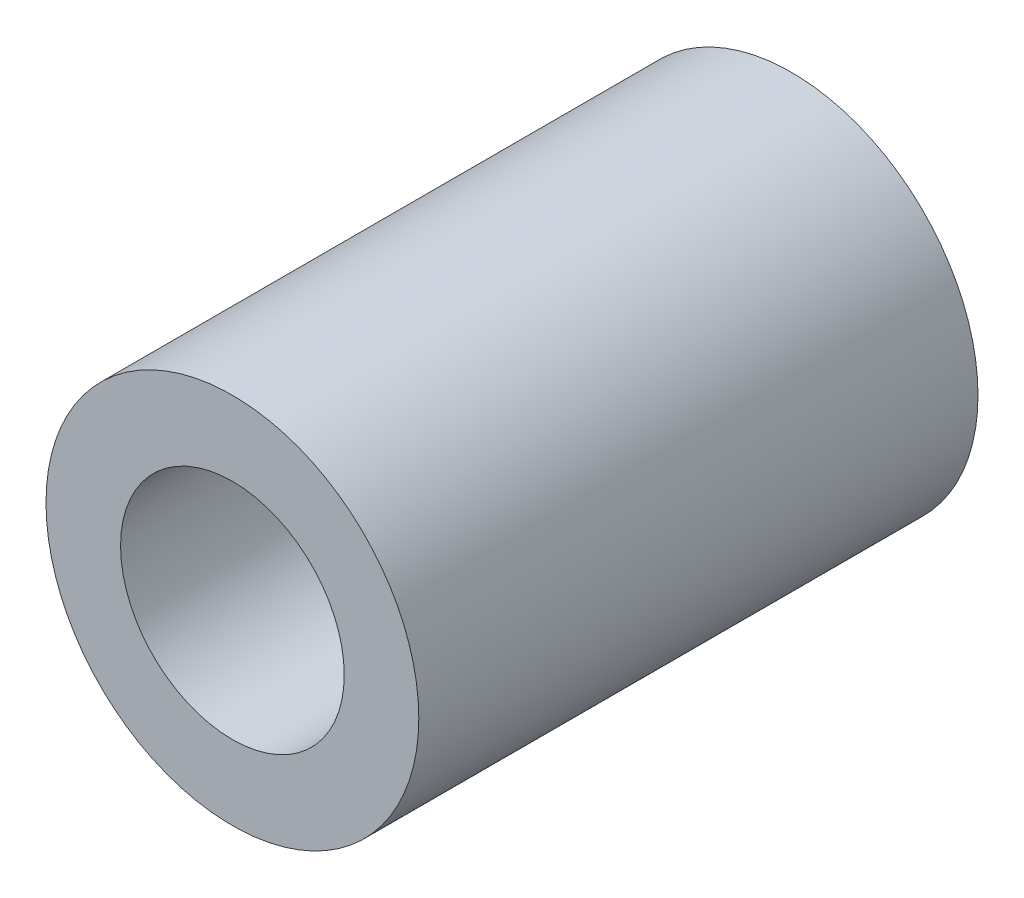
ISO-10303-21;
HEADER;
FILE_DESCRIPTION(('STEP AP214'),'2;1');
FILE_NAME('part.step','',(''),(''),'','','');
FILE_SCHEMA(('AUTOMOTIVE_DESIGN { 1 0 10303 214 1 1 1 1 }'));
ENDSEC;
DATA;
#1=APPLICATION_CONTEXT('core data for automotive mechanical design processes');
#2=APPLICATION_PROTOCOL_DEFINITION('international standard','automotive_design',2000,#1);
#3=PRODUCT_CONTEXT('',#1,'mechanical');
#4=PRODUCT('Part','Part','',(#3));
#5=PRODUCT_RELATED_PRODUCT_CATEGORY('part','',(#4));
#6=PRODUCT_DEFINITION_FORMATION('','',#4);
#7=PRODUCT_DEFINITION_CONTEXT('part definition',#1,'design');
#8=PRODUCT_DEFINITION('design','',#6,#7);
#9=PRODUCT_DEFINITION_SHAPE('','',#8);
#10=(LENGTH_UNIT() NAMED_UNIT(*) SI_UNIT(.MILLI.,.METRE.));
#11=(NAMED_UNIT(*) PLANE_ANGLE_UNIT() SI_UNIT($,.RADIAN.));
#12=(NAMED_UNIT(*) SI_UNIT($,.STERADIAN.) SOLID_ANGLE_UNIT());
#13=UNCERTAINTY_MEASURE_WITH_UNIT(LENGTH_MEASURE(1.E-05),#10,'distance_accuracy_value','');
#14=(GEOMETRIC_REPRESENTATION_CONTEXT(3) GLOBAL_UNCERTAINTY_ASSIGNED_CONTEXT((#13)) GLOBAL_UNIT_ASSIGNED_CONTEXT((#10,
#11,#12)) REPRESENTATION_CONTEXT('',''));
#15=CARTESIAN_POINT('',(0.,0.,0.));
#16=DIRECTION('',(0.,0.,1.));
#17=DIRECTION('',(1.,0.,0.));
#18=AXIS2_PLACEMENT_3D('',#15,#16,#17);
#19=CARTESIAN_POINT('',(0.,0.,30.));
#20=DIRECTION('',(0.,0.,1.));
#21=DIRECTION('',(1.,0.,0.));
#22=AXIS2_PLACEMENT_3D('',#19,#20,#21);
#23=PLANE('',#22);
#24=CARTESIAN_POINT('',(0.,0.,30.));
#25=DIRECTION('',(0.,0.,1.));
#26=DIRECTION('',(1.,0.,0.));
#27=AXIS2_PLACEMENT_3D('',#24,#25,#26);
#28=CIRCLE('',#27,10.);
#29=CARTESIAN_POINT('',(10.,0.,30.));
#30=VERTEX_POINT('',#29);
#31=EDGE_CURVE('E10',#30,#30,#28,.T.);
#32=ORIENTED_EDGE('',*,*,#31,.T.);
#33=EDGE_LOOP('',(#32));
#34=FACE_BOUND('',#33,.T.);
#35=CARTESIAN_POINT('',(0.,0.,30.));
#36=DIRECTION('',(0.,0.,1.));
#37=DIRECTION('',(1.,0.,0.));
#38=AXIS2_PLACEMENT_3D('',#35,#36,#37);
#39=CIRCLE('',#38,6.);
#40=CARTESIAN_POINT('',(6.,0.,30.));
#41=VERTEX_POINT('',#40);
#42=EDGE_CURVE('E43',#41,#41,#39,.T.);
#43=ORIENTED_EDGE('',*,*,#42,.F.);
#44=EDGE_LOOP('',(#43));
#45=FACE_BOUND('',#44,.T.);
#46=ADVANCED_FACE('F32',(#34,#45),#23,.T.);
#47=CARTESIAN_POINT('',(0.,0.,0.));
#48=DIRECTION('',(0.,0.,1.));
#49=DIRECTION('',(1.,0.,0.));
#50=AXIS2_PLACEMENT_3D('',#47,#48,#49);
#51=PLANE('',#50);
#52=CARTESIAN_POINT('',(0.,0.,0.));
#53=DIRECTION('',(0.,0.,1.));
#54=DIRECTION('',(1.,0.,0.));
#55=AXIS2_PLACEMENT_3D('',#52,#53,#54);
#56=CIRCLE('',#55,10.);
#57=CARTESIAN_POINT('',(10.,0.,0.));
#58=VERTEX_POINT('',#57);
#59=EDGE_CURVE('E39',#58,#58,#56,.T.);
#60=ORIENTED_EDGE('',*,*,#59,.F.);
#61=EDGE_LOOP('',(#60));
#62=FACE_BOUND('',#61,.T.);
#63=CARTESIAN_POINT('',(0.,0.,0.));
#64=DIRECTION('',(0.,0.,1.));
#65=DIRECTION('',(1.,0.,0.));
#66=AXIS2_PLACEMENT_3D('',#63,#64,#65);
#67=CIRCLE('',#66,6.);
#68=CARTESIAN_POINT('',(6.,0.,0.));
#69=VERTEX_POINT('',#68);
#70=EDGE_CURVE('E47',#69,#69,#67,.T.);
#71=ORIENTED_EDGE('',*,*,#70,.T.);
#72=EDGE_LOOP('',(#71));
#73=FACE_BOUND('',#72,.T.);
#74=ADVANCED_FACE('F53',(#62,#73),#51,.F.);
#75=CARTESIAN_POINT('',(0.,0.,30.));
#76=DIRECTION('',(0.,0.,-1.));
#77=DIRECTION('',(-1.,0.,0.));
#78=AXIS2_PLACEMENT_3D('',#75,#76,#77);
#79=CYLINDRICAL_SURFACE('',#78,10.);
#80=ORIENTED_EDGE('',*,*,#31,.F.);
#81=EDGE_LOOP('',(#80));
#82=FACE_BOUND('',#81,.T.);
#83=ORIENTED_EDGE('',*,*,#59,.T.);
#84=EDGE_LOOP('',(#83));
#85=FACE_BOUND('',#84,.T.);
#86=ADVANCED_FACE('F34',(#82,#85),#79,.T.);
#87=CARTESIAN_POINT('',(0.,0.,30.));
#88=DIRECTION('',(0.,0.,-1.));
#89=DIRECTION('',(-1.,0.,0.));
#90=AXIS2_PLACEMENT_3D('',#87,#88,#89);
#91=CYLINDRICAL_SURFACE('',#90,6.);
#92=ORIENTED_EDGE('',*,*,#42,.T.);
#93=EDGE_LOOP('',(#92));
#94=FACE_BOUND('',#93,.T.);
#95=ORIENTED_EDGE('',*,*,#70,.F.);
#96=EDGE_LOOP('',(#95));
#97=FACE_BOUND('',#96,.T.);
#98=ADVANCED_FACE('F55',(#94,#97),#91,.F.);
#99=CLOSED_SHELL('',(#46,#74,#86,#98));
#100=MANIFOLD_SOLID_BREP('B2',#99);
#101=ADVANCED_BREP_SHAPE_REPRESENTATION('',(#18,#100),#14);
#102=SHAPE_DEFINITION_REPRESENTATION(#9,#101);
ENDSEC;
END-ISO-10303-21;
